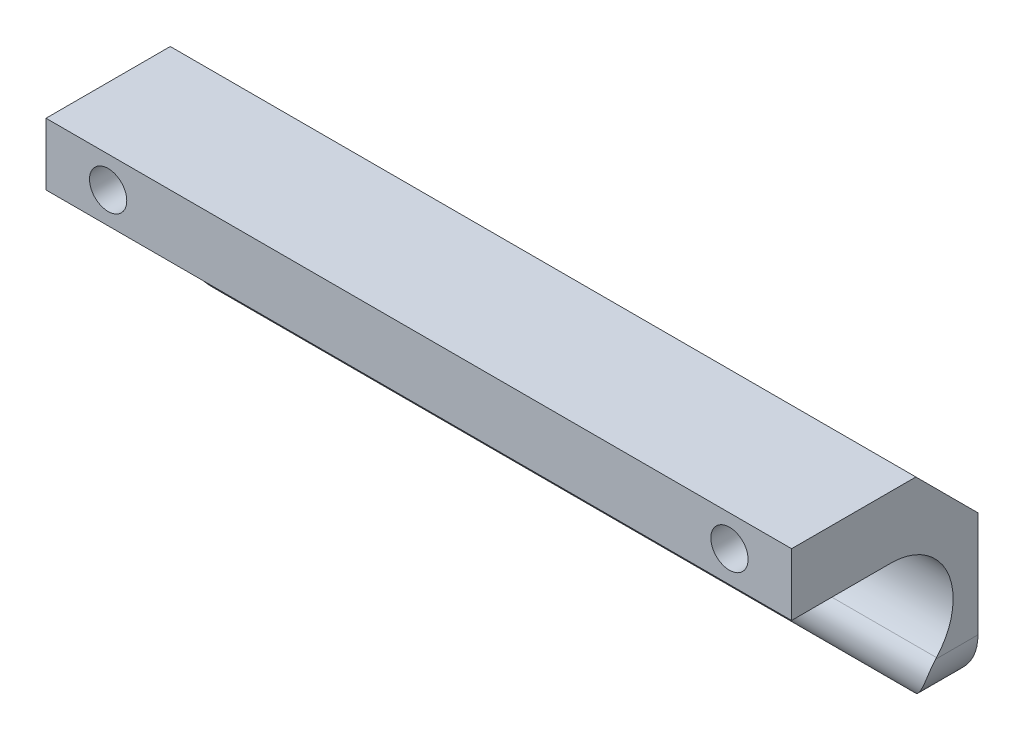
ISO-10303-21;
HEADER;
FILE_DESCRIPTION(('STEP AP214'),'2;1');
FILE_NAME('part.step','',(''),(''),'','','');
FILE_SCHEMA(('AUTOMOTIVE_DESIGN { 1 0 10303 214 1 1 1 1 }'));
ENDSEC;
DATA;
#1=APPLICATION_CONTEXT('core data for automotive mechanical design processes');
#2=APPLICATION_PROTOCOL_DEFINITION('international standard','automotive_design',2000,#1);
#3=PRODUCT_CONTEXT('',#1,'mechanical');
#4=PRODUCT('Part','Part','',(#3));
#5=PRODUCT_RELATED_PRODUCT_CATEGORY('part','',(#4));
#6=PRODUCT_DEFINITION_FORMATION('','',#4);
#7=PRODUCT_DEFINITION_CONTEXT('part definition',#1,'design');
#8=PRODUCT_DEFINITION('design','',#6,#7);
#9=PRODUCT_DEFINITION_SHAPE('','',#8);
#10=(LENGTH_UNIT() NAMED_UNIT(*) SI_UNIT(.MILLI.,.METRE.));
#11=(NAMED_UNIT(*) PLANE_ANGLE_UNIT() SI_UNIT($,.RADIAN.));
#12=(NAMED_UNIT(*) SI_UNIT($,.STERADIAN.) SOLID_ANGLE_UNIT());
#13=UNCERTAINTY_MEASURE_WITH_UNIT(LENGTH_MEASURE(1.E-05),#10,'distance_accuracy_value','');
#14=(GEOMETRIC_REPRESENTATION_CONTEXT(3) GLOBAL_UNCERTAINTY_ASSIGNED_CONTEXT((#13)) GLOBAL_UNIT_ASSIGNED_CONTEXT((#10,
#11,#12)) REPRESENTATION_CONTEXT('',''));
#15=CARTESIAN_POINT('',(0.,0.,0.));
#16=DIRECTION('',(0.,0.,1.));
#17=DIRECTION('',(1.,0.,0.));
#18=AXIS2_PLACEMENT_3D('',#15,#16,#17);
#19=CARTESIAN_POINT('',(-60.,17.5,-15.));
#20=DIRECTION('',(-1.,0.,0.));
#21=DIRECTION('',(0.,0.,1.));
#22=AXIS2_PLACEMENT_3D('',#19,#20,#21);
#23=PLANE('',#22);
#24=DIRECTION('',(0.,1.,0.));
#25=VECTOR('',#24,1.);
#26=CARTESIAN_POINT('',(-60.,-17.5,-15.));
#27=LINE('',#26,#25);
#28=CARTESIAN_POINT('',(-60.,-9.5,-15.));
#29=VERTEX_POINT('',#28);
#30=CARTESIAN_POINT('',(-60.,7.49999999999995,-15.));
#31=VERTEX_POINT('',#30);
#32=EDGE_CURVE('E203',#29,#31,#27,.T.);
#33=ORIENTED_EDGE('',*,*,#32,.F.);
#34=DIRECTION('',(0.,0.,-1.));
#35=VECTOR('',#34,1.);
#36=CARTESIAN_POINT('',(-60.,-9.5,15.));
#37=LINE('',#36,#35);
#38=CARTESIAN_POINT('',(-60.,-9.5,-8.15302564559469));
#39=VERTEX_POINT('',#38);
#40=EDGE_CURVE('E163',#39,#29,#37,.T.);
#41=ORIENTED_EDGE('',*,*,#40,.F.);
#42=CARTESIAN_POINT('',(-60.,-12.642135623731,-11.857864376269));
#43=DIRECTION('',(1.,0.,0.));
#44=DIRECTION('',(0.,0.,-1.));
#45=AXIS2_PLACEMENT_3D('',#42,#43,#44);
#46=CIRCLE('',#45,4.85786437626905);
#47=CARTESIAN_POINT('',(-60.,-9.32610593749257,-8.30782305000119));
#48=VERTEX_POINT('',#47);
#49=EDGE_CURVE('E176',#48,#39,#46,.T.);
#50=ORIENTED_EDGE('',*,*,#49,.F.);
#51=CARTESIAN_POINT('',(-60.,-2.5,-0.999999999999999));
#52=DIRECTION('',(1.,0.,0.));
#53=DIRECTION('',(0.,0.,-1.));
#54=AXIS2_PLACEMENT_3D('',#51,#52,#53);
#55=CIRCLE('',#54,10.);
#56=CARTESIAN_POINT('',(-60.,7.5,-1.));
#57=VERTEX_POINT('',#56);
#58=EDGE_CURVE('E180',#48,#57,#55,.T.);
#59=ORIENTED_EDGE('',*,*,#58,.T.);
#60=DIRECTION('',(0.,0.,1.));
#61=VECTOR('',#60,1.);
#62=CARTESIAN_POINT('',(-60.,7.5,-35.9970345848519));
#63=LINE('',#62,#61);
#64=CARTESIAN_POINT('',(-60.,7.5,15.));
#65=VERTEX_POINT('',#64);
#66=EDGE_CURVE('E185',#57,#65,#63,.T.);
#67=ORIENTED_EDGE('',*,*,#66,.T.);
#68=DIRECTION('',(0.,-1.,0.));
#69=VECTOR('',#68,1.);
#70=CARTESIAN_POINT('',(-60.,-17.5,15.));
#71=LINE('',#70,#69);
#72=CARTESIAN_POINT('',(-60.,17.5,15.));
#73=VERTEX_POINT('',#72);
#74=EDGE_CURVE('E212',#73,#65,#71,.T.);
#75=ORIENTED_EDGE('',*,*,#74,.F.);
#76=DIRECTION('',(0.,0.,1.));
#77=VECTOR('',#76,1.);
#78=CARTESIAN_POINT('',(-60.,17.5,15.));
#79=LINE('',#78,#77);
#80=CARTESIAN_POINT('',(-60.,17.5,-4.99999999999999));
#81=VERTEX_POINT('',#80);
#82=EDGE_CURVE('E222',#81,#73,#79,.T.);
#83=ORIENTED_EDGE('',*,*,#82,.F.);
#84=DIRECTION('',(0.,0.707106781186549,0.707106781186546));
#85=VECTOR('',#84,1.);
#86=CARTESIAN_POINT('',(-60.,12.5,-9.99999999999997));
#87=LINE('',#86,#85);
#88=EDGE_CURVE('E235',#81,#31,#87,.F.);
#89=ORIENTED_EDGE('',*,*,#88,.T.);
#90=EDGE_LOOP('',(#33,#41,#50,#59,#67,#75,#83,#89));
#91=FACE_BOUND('',#90,.T.);
#92=ADVANCED_FACE('F37',(#91),#23,.T.);
#93=CARTESIAN_POINT('',(60.,17.5,-15.));
#94=DIRECTION('',(-1.,0.,0.));
#95=DIRECTION('',(0.,0.,1.));
#96=AXIS2_PLACEMENT_3D('',#93,#94,#95);
#97=PLANE('',#96);
#98=DIRECTION('',(0.,0.,-1.));
#99=VECTOR('',#98,1.);
#100=CARTESIAN_POINT('',(60.,-9.5,15.));
#101=LINE('',#100,#99);
#102=CARTESIAN_POINT('',(60.,-9.5,-8.15302564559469));
#103=VERTEX_POINT('',#102);
#104=CARTESIAN_POINT('',(60.,-9.5,-15.));
#105=VERTEX_POINT('',#104);
#106=EDGE_CURVE('E169',#103,#105,#101,.T.);
#107=ORIENTED_EDGE('',*,*,#106,.T.);
#108=DIRECTION('',(0.,1.,0.));
#109=VECTOR('',#108,1.);
#110=CARTESIAN_POINT('',(60.,-17.5,-15.));
#111=LINE('',#110,#109);
#112=CARTESIAN_POINT('',(60.,7.49999999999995,-15.));
#113=VERTEX_POINT('',#112);
#114=EDGE_CURVE('E208',#105,#113,#111,.T.);
#115=ORIENTED_EDGE('',*,*,#114,.T.);
#116=DIRECTION('',(0.,-0.707106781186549,-0.707106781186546));
#117=VECTOR('',#116,1.);
#118=CARTESIAN_POINT('',(60.,17.5,-4.99999999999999));
#119=LINE('',#118,#117);
#120=CARTESIAN_POINT('',(60.,17.5,-4.99999999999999));
#121=VERTEX_POINT('',#120);
#122=EDGE_CURVE('E243',#113,#121,#119,.F.);
#123=ORIENTED_EDGE('',*,*,#122,.T.);
#124=DIRECTION('',(0.,0.,1.));
#125=VECTOR('',#124,1.);
#126=CARTESIAN_POINT('',(60.,17.5,15.));
#127=LINE('',#126,#125);
#128=CARTESIAN_POINT('',(60.,17.5,15.));
#129=VERTEX_POINT('',#128);
#130=EDGE_CURVE('E211',#121,#129,#127,.T.);
#131=ORIENTED_EDGE('',*,*,#130,.T.);
#132=DIRECTION('',(0.,-1.,0.));
#133=VECTOR('',#132,1.);
#134=CARTESIAN_POINT('',(60.,-17.5,15.));
#135=LINE('',#134,#133);
#136=CARTESIAN_POINT('',(60.,7.5,15.));
#137=VERTEX_POINT('',#136);
#138=EDGE_CURVE('E215',#129,#137,#135,.T.);
#139=ORIENTED_EDGE('',*,*,#138,.T.);
#140=DIRECTION('',(0.,0.,1.));
#141=VECTOR('',#140,1.);
#142=CARTESIAN_POINT('',(60.,7.5,-35.9970345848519));
#143=LINE('',#142,#141);
#144=CARTESIAN_POINT('',(60.,7.5,-1.));
#145=VERTEX_POINT('',#144);
#146=EDGE_CURVE('E181',#145,#137,#143,.T.);
#147=ORIENTED_EDGE('',*,*,#146,.F.);
#148=CARTESIAN_POINT('',(60.,-2.5,-0.999999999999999));
#149=DIRECTION('',(1.,0.,0.));
#150=DIRECTION('',(0.,0.,-1.));
#151=AXIS2_PLACEMENT_3D('',#148,#149,#150);
#152=CIRCLE('',#151,10.);
#153=CARTESIAN_POINT('',(60.,-9.32610593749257,-8.30782305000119));
#154=VERTEX_POINT('',#153);
#155=EDGE_CURVE('E193',#154,#145,#152,.T.);
#156=ORIENTED_EDGE('',*,*,#155,.F.);
#157=CARTESIAN_POINT('',(60.,-12.642135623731,-11.857864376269));
#158=DIRECTION('',(1.,0.,0.));
#159=DIRECTION('',(0.,0.,-1.));
#160=AXIS2_PLACEMENT_3D('',#157,#158,#159);
#161=CIRCLE('',#160,4.85786437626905);
#162=EDGE_CURVE('E175',#154,#103,#161,.T.);
#163=ORIENTED_EDGE('',*,*,#162,.T.);
#164=EDGE_LOOP('',(#107,#115,#123,#131,#139,#147,#156,#163));
#165=FACE_BOUND('',#164,.T.);
#166=ADVANCED_FACE('F267',(#165),#97,.F.);
#167=CARTESIAN_POINT('',(60.,-17.5,-15.));
#168=DIRECTION('',(0.,0.,1.));
#169=DIRECTION('',(1.,0.,0.));
#170=AXIS2_PLACEMENT_3D('',#167,#168,#169);
#171=PLANE('',#170);
#172=DIRECTION('',(1.,0.,0.));
#173=VECTOR('',#172,1.);
#174=CARTESIAN_POINT('',(-60.,-16.3469743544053,-15.));
#175=LINE('',#174,#173);
#176=CARTESIAN_POINT('',(-56.1375043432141,-16.3469743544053,-15.));
#177=VERTEX_POINT('',#176);
#178=CARTESIAN_POINT('',(56.1375043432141,-16.3469743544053,-15.));
#179=VERTEX_POINT('',#178);
#180=EDGE_CURVE('E172',#177,#179,#175,.T.);
#181=ORIENTED_EDGE('',*,*,#180,.F.);
#182=CARTESIAN_POINT('',(-52.,-9.5,-15.));
#183=DIRECTION('',(0.,0.,1.));
#184=DIRECTION('',(-1.,0.,0.));
#185=AXIS2_PLACEMENT_3D('',#182,#183,#184);
#186=CIRCLE('',#185,8.);
#187=EDGE_CURVE('E160',#29,#177,#186,.T.);
#188=ORIENTED_EDGE('',*,*,#187,.F.);
#189=ORIENTED_EDGE('',*,*,#32,.T.);
#190=DIRECTION('',(1.,0.,0.));
#191=VECTOR('',#190,1.);
#192=CARTESIAN_POINT('',(60.,7.49999999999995,-15.));
#193=LINE('',#192,#191);
#194=EDGE_CURVE('E239',#31,#113,#193,.T.);
#195=ORIENTED_EDGE('',*,*,#194,.T.);
#196=ORIENTED_EDGE('',*,*,#114,.F.);
#197=CARTESIAN_POINT('',(52.,-9.5,-15.));
#198=DIRECTION('',(0.,0.,1.));
#199=DIRECTION('',(-1.,0.,0.));
#200=AXIS2_PLACEMENT_3D('',#197,#198,#199);
#201=CIRCLE('',#200,8.);
#202=EDGE_CURVE('E166',#179,#105,#201,.T.);
#203=ORIENTED_EDGE('',*,*,#202,.F.);
#204=EDGE_LOOP('',(#181,#188,#189,#195,#196,#203));
#205=FACE_BOUND('',#204,.T.);
#206=ADVANCED_FACE('F314',(#205),#171,.F.);
#207=CARTESIAN_POINT('',(60.,17.5,15.));
#208=DIRECTION('',(0.,-1.,0.));
#209=DIRECTION('',(0.,0.,-1.));
#210=AXIS2_PLACEMENT_3D('',#207,#208,#209);
#211=PLANE('',#210);
#212=ORIENTED_EDGE('',*,*,#130,.F.);
#213=DIRECTION('',(-1.,0.,0.));
#214=VECTOR('',#213,1.);
#215=CARTESIAN_POINT('',(60.,17.5,-4.99999999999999));
#216=LINE('',#215,#214);
#217=EDGE_CURVE('E231',#121,#81,#216,.T.);
#218=ORIENTED_EDGE('',*,*,#217,.T.);
#219=ORIENTED_EDGE('',*,*,#82,.T.);
#220=DIRECTION('',(-1.,0.,0.));
#221=VECTOR('',#220,1.);
#222=CARTESIAN_POINT('',(60.,17.5,15.));
#223=LINE('',#222,#221);
#224=EDGE_CURVE('E219',#129,#73,#223,.T.);
#225=ORIENTED_EDGE('',*,*,#224,.F.);
#226=EDGE_LOOP('',(#212,#218,#219,#225));
#227=FACE_BOUND('',#226,.T.);
#228=ADVANCED_FACE('F321',(#227),#211,.F.);
#229=CARTESIAN_POINT('',(60.,-17.5,15.));
#230=DIRECTION('',(0.,0.,-1.));
#231=DIRECTION('',(-1.,0.,0.));
#232=AXIS2_PLACEMENT_3D('',#229,#230,#231);
#233=PLANE('',#232);
#234=CARTESIAN_POINT('',(50.,12.5,15.));
#235=DIRECTION('',(0.,0.,1.));
#236=DIRECTION('',(1.,0.,0.));
#237=AXIS2_PLACEMENT_3D('',#234,#235,#236);
#238=CIRCLE('',#237,3.);
#239=CARTESIAN_POINT('',(53.,12.5,15.));
#240=VERTEX_POINT('',#239);
#241=EDGE_CURVE('E353',#240,#240,#238,.T.);
#242=ORIENTED_EDGE('',*,*,#241,.F.);
#243=EDGE_LOOP('',(#242));
#244=FACE_BOUND('',#243,.T.);
#245=CARTESIAN_POINT('',(-50.,12.5,15.));
#246=DIRECTION('',(0.,0.,1.));
#247=DIRECTION('',(1.,0.,0.));
#248=AXIS2_PLACEMENT_3D('',#245,#246,#247);
#249=CIRCLE('',#248,3.);
#250=CARTESIAN_POINT('',(-47.,12.5,15.));
#251=VERTEX_POINT('',#250);
#252=EDGE_CURVE('E134',#251,#251,#249,.T.);
#253=ORIENTED_EDGE('',*,*,#252,.F.);
#254=EDGE_LOOP('',(#253));
#255=FACE_BOUND('',#254,.T.);
#256=ORIENTED_EDGE('',*,*,#74,.T.);
#257=DIRECTION('',(1.,0.,0.));
#258=VECTOR('',#257,1.);
#259=CARTESIAN_POINT('',(-60.,7.5,15.));
#260=LINE('',#259,#258);
#261=EDGE_CURVE('E199',#65,#137,#260,.T.);
#262=ORIENTED_EDGE('',*,*,#261,.T.);
#263=ORIENTED_EDGE('',*,*,#138,.F.);
#264=ORIENTED_EDGE('',*,*,#224,.T.);
#265=EDGE_LOOP('',(#256,#262,#263,#264));
#266=FACE_BOUND('',#265,.T.);
#267=ADVANCED_FACE('F318',(#244,#255,#266),#233,.F.);
#268=CARTESIAN_POINT('',(60.,17.5,-4.99999999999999));
#269=DIRECTION('',(0.,-0.707106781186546,0.707106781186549));
#270=DIRECTION('',(0.,-0.707106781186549,-0.707106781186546));
#271=AXIS2_PLACEMENT_3D('',#268,#269,#270);
#272=PLANE('',#271);
#273=ORIENTED_EDGE('',*,*,#122,.F.);
#274=ORIENTED_EDGE('',*,*,#194,.F.);
#275=ORIENTED_EDGE('',*,*,#88,.F.);
#276=ORIENTED_EDGE('',*,*,#217,.F.);
#277=EDGE_LOOP('',(#273,#274,#275,#276));
#278=FACE_BOUND('',#277,.T.);
#279=ADVANCED_FACE('F39',(#278),#272,.F.);
#280=CARTESIAN_POINT('',(-60.,-12.642135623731,-11.857864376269));
#281=DIRECTION('',(1.,0.,0.));
#282=DIRECTION('',(0.,0.,-1.));
#283=AXIS2_PLACEMENT_3D('',#280,#281,#282);
#284=CYLINDRICAL_SURFACE('',#283,4.85786437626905);
#285=CARTESIAN_POINT('',(-56.1375043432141,-16.3469743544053,-15.));
#286=CARTESIAN_POINT('',(-56.0261493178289,-16.4142592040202,-14.9206561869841));
#287=CARTESIAN_POINT('',(-55.9139235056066,-16.4783721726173,-14.8399052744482));
#288=CARTESIAN_POINT('',(-55.6879480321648,-16.6003901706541,-14.6759350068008));
#289=CARTESIAN_POINT('',(-55.5741986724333,-16.6582964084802,-14.5927161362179));
#290=CARTESIAN_POINT('',(-55.2311071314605,-16.8228592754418,-14.3399621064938));
#291=CARTESIAN_POINT('',(-54.9997446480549,-16.9204660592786,-14.167202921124));
#292=CARTESIAN_POINT('',(-54.5341663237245,-17.0920563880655,-13.8161969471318));
#293=CARTESIAN_POINT('',(-54.2999657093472,-17.1661334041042,-13.6379750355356));
#294=CARTESIAN_POINT('',(-53.8289391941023,-17.2919435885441,-13.2772338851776));
#295=CARTESIAN_POINT('',(-53.5921135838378,-17.3436792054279,-13.0947151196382));
#296=CARTESIAN_POINT('',(-53.1319730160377,-17.422727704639,-12.738708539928));
#297=CARTESIAN_POINT('',(-52.9087578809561,-17.4513858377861,-12.5653856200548));
#298=CARTESIAN_POINT('',(-52.4617109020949,-17.4898128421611,-12.2176471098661));
#299=CARTESIAN_POINT('',(-52.2378795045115,-17.4995929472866,-12.04323223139));
#300=CARTESIAN_POINT('',(-52.0094068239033,-17.4999958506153,-11.8651946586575));
#301=CARTESIAN_POINT('',(-52.0047033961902,-17.4999999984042,-11.8615295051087));
#302=CARTESIAN_POINT('',(-52.,-17.5,-11.857864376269));
#303=B_SPLINE_CURVE_WITH_KNOTS('',3,(#285,#286,#287,#288,#289,#290,#291,#292,#293,#294,#295,
#296,#297,#298,#299,#300,#301,#302),.UNSPECIFIED.,.F.,.F.,(4,2,2,2,2,2,2,2,4),(0.,
0.457072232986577,0.914055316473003,1.82729816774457,2.73686646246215,3.64633504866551,
4.49789854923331,5.348955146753,5.36684369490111),.UNSPECIFIED.);
#304=CARTESIAN_POINT('',(-52.,-17.5,-11.857864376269));
#305=VERTEX_POINT('',#304);
#306=EDGE_CURVE('E11',#177,#305,#303,.T.);
#307=ORIENTED_EDGE('',*,*,#306,.F.);
#308=ORIENTED_EDGE('',*,*,#180,.T.);
#309=CARTESIAN_POINT('',(56.1375043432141,-16.3469743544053,-15.));
#310=CARTESIAN_POINT('',(56.0261493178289,-16.4142592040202,-14.9206561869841));
#311=CARTESIAN_POINT('',(55.9139235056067,-16.4783721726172,-14.8399052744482));
#312=CARTESIAN_POINT('',(55.687948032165,-16.600390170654,-14.6759350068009));
#313=CARTESIAN_POINT('',(55.5741986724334,-16.6582964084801,-14.592716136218));
#314=CARTESIAN_POINT('',(55.2311071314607,-16.8228592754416,-14.339962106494));
#315=CARTESIAN_POINT('',(54.9997446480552,-16.9204660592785,-14.1672029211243));
#316=CARTESIAN_POINT('',(54.5341663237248,-17.0920563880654,-13.816196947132));
#317=CARTESIAN_POINT('',(54.2999657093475,-17.1661334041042,-13.6379750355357));
#318=CARTESIAN_POINT('',(53.8289391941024,-17.2919435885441,-13.2772338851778));
#319=CARTESIAN_POINT('',(53.5921135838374,-17.3436792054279,-13.0947151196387));
#320=CARTESIAN_POINT('',(53.1319730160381,-17.4227277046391,-12.7387085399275));
#321=CARTESIAN_POINT('',(52.9087578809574,-17.4513858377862,-12.5653856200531));
#322=CARTESIAN_POINT('',(52.4617109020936,-17.4898128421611,-12.2176471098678));
#323=CARTESIAN_POINT('',(52.2378795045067,-17.4995929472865,-12.0432322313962));
#324=CARTESIAN_POINT('',(52.0094068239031,-17.4999958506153,-11.8651946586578));
#325=CARTESIAN_POINT('',(52.0047033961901,-17.4999999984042,-11.8615295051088));
#326=CARTESIAN_POINT('',(52.,-17.5,-11.857864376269));
#327=B_SPLINE_CURVE_WITH_KNOTS('',3,(#309,#310,#311,#312,#313,#314,#315,#316,#317,#318,#319,
#320,#321,#322,#323,#324,#325,#326),.UNSPECIFIED.,.F.,.F.,(4,2,2,2,2,2,2,2,4),(0.,
0.457072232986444,0.91405531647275,1.82729816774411,2.73686646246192,3.6463350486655,
4.49789854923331,5.348955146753,5.3668436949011),.UNSPECIFIED.);
#328=CARTESIAN_POINT('',(52.,-17.5,-11.857864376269));
#329=VERTEX_POINT('',#328);
#330=EDGE_CURVE('E246',#329,#179,#327,.F.);
#331=ORIENTED_EDGE('',*,*,#330,.F.);
#332=CARTESIAN_POINT('',(60.,-9.5,-8.15302564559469));
#333=CARTESIAN_POINT('',(60.0000097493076,-9.59352523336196,-8.07368202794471));
#334=CARTESIAN_POINT('',(59.9983604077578,-9.69008993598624,-7.99789663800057));
#335=CARTESIAN_POINT('',(59.9911711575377,-9.88859852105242,-7.85388207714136));
#336=CARTESIAN_POINT('',(59.9856301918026,-9.99054385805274,-7.78565496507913));
#337=CARTESIAN_POINT('',(59.9700913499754,-10.198972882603,-7.65729543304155));
#338=CARTESIAN_POINT('',(59.9600973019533,-10.3054526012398,-7.59715611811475));
#339=CARTESIAN_POINT('',(59.9351784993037,-10.52217077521,-7.48528386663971));
#340=CARTESIAN_POINT('',(59.9202543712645,-10.6324087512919,-7.43354986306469));
#341=CARTESIAN_POINT('',(59.8850588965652,-10.8559787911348,-7.33865317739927));
#342=CARTESIAN_POINT('',(59.8647759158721,-10.9693170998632,-7.29550950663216));
#343=CARTESIAN_POINT('',(59.8186122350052,-11.1979113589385,-7.21807659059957));
#344=CARTESIAN_POINT('',(59.7927294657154,-11.3131680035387,-7.1837906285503));
#345=CARTESIAN_POINT('',(59.735281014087,-11.5444077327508,-7.12414698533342));
#346=CARTESIAN_POINT('',(59.703722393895,-11.6603897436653,-7.09877832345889));
#347=CARTESIAN_POINT('',(59.6348944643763,-11.8922834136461,-7.05677505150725));
#348=CARTESIAN_POINT('',(59.5976230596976,-12.0081950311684,-7.04014365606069));
#349=CARTESIAN_POINT('',(59.51821752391,-12.2369330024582,-7.01558661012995));
#350=CARTESIAN_POINT('',(59.4761815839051,-12.34977757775,-7.00751149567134));
#351=CARTESIAN_POINT('',(59.386927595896,-12.5737336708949,-6.99918860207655));
#352=CARTESIAN_POINT('',(59.3397075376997,-12.6848444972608,-6.99894387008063));
#353=CARTESIAN_POINT('',(59.2403552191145,-12.9046752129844,-7.00585245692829));
#354=CARTESIAN_POINT('',(59.188220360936,-13.0133938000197,-7.01300970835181));
#355=CARTESIAN_POINT('',(59.0793844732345,-13.2278389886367,-7.03423365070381));
#356=CARTESIAN_POINT('',(59.0226824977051,-13.3335649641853,-7.04830177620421));
#357=CARTESIAN_POINT('',(58.8837240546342,-13.5793186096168,-7.08909377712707));
#358=CARTESIAN_POINT('',(58.7996590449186,-13.7178767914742,-7.11855734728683));
#359=CARTESIAN_POINT('',(58.6246176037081,-13.9877993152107,-7.18801715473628));
#360=CARTESIAN_POINT('',(58.5336391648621,-14.1191615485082,-7.22801645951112));
#361=CARTESIAN_POINT('',(58.34555598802,-14.3743273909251,-7.3173084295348));
#362=CARTESIAN_POINT('',(58.2484445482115,-14.4981224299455,-7.36661138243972));
#363=CARTESIAN_POINT('',(58.0489770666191,-14.7377664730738,-7.47330173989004));
#364=CARTESIAN_POINT('',(57.9466195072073,-14.8536131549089,-7.53069149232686));
#365=CARTESIAN_POINT('',(57.6981722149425,-15.11917656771,-7.67530997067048));
#366=CARTESIAN_POINT('',(57.5500680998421,-15.2653178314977,-7.76566141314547));
#367=CARTESIAN_POINT('',(57.24698708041,-15.5424592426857,-7.95717871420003));
#368=CARTESIAN_POINT('',(57.0920104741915,-15.6734600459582,-8.05834410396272));
#369=CARTESIAN_POINT('',(56.7761676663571,-15.9209458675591,-8.26972021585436));
#370=CARTESIAN_POINT('',(56.615290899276,-16.0374030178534,-8.37994765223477));
#371=CARTESIAN_POINT('',(56.2890167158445,-16.2559526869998,-8.60762234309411));
#372=CARTESIAN_POINT('',(56.1236192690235,-16.3580451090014,-8.72506964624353));
#373=CARTESIAN_POINT('',(55.7251962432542,-16.5847491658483,-9.0118749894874));
#374=CARTESIAN_POINT('',(55.4904917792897,-16.7030468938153,-9.18391192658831));
#375=CARTESIAN_POINT('',(55.0159252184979,-16.9142900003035,-9.53627860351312));
#376=CARTESIAN_POINT('',(54.7760611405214,-17.0072254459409,-9.71661156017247));
#377=CARTESIAN_POINT('',(54.2929259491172,-17.1685898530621,-10.0830184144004));
#378=CARTESIAN_POINT('',(54.0496584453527,-17.2370429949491,-10.2690864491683));
#379=CARTESIAN_POINT('',(53.5608069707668,-17.3502768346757,-10.6450941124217));
#380=CARTESIAN_POINT('',(53.3152234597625,-17.395062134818,-10.8350329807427));
#381=CARTESIAN_POINT('',(52.7182200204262,-17.4755446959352,-11.2982018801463));
#382=CARTESIAN_POINT('',(52.366010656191,-17.4993671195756,-11.5726501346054));
#383=CARTESIAN_POINT('',(52.0094067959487,-17.4999958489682,-11.8505341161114));
#384=CARTESIAN_POINT('',(52.0047033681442,-17.4999999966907,-11.8541992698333));
#385=CARTESIAN_POINT('',(52.,-17.5,-11.857864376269));
#386=B_SPLINE_CURVE_WITH_KNOTS('',3,(#332,#333,#334,#335,#336,#337,#338,#339,#340,#341,#342,
#343,#344,#345,#346,#347,#348,#349,#350,#351,#352,#353,#354,#355,#356,#357,#358,#359,#360,#361,
#362,#363,#364,#365,#366,#367,#368,#369,#370,#371,#372,#373,#374,#375,#376,#377,#378,#379,#380,
#381,#382,#383,#384,#385),.UNSPECIFIED.,.F.,.F.,(4,2,2,2,2,2,2,2,2,2,2,2,2,2,2,2,2,2,2,2,2,2,2,
2,2,2,4),(0.,0.367866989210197,0.735833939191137,1.10348517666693,1.47108970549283,
1.83949895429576,2.2080445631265,2.57613474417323,2.94436025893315,3.30604174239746,
3.66786397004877,4.02987852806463,4.391968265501,4.8854077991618,5.3789911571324,
5.87312353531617,6.36739967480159,7.04689686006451,7.72636459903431,8.40711495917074,
9.08786990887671,10.0289002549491,10.9702986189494,11.910764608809,12.8510476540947,
14.189414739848,14.2073032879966),.UNSPECIFIED.);
#387=EDGE_CURVE('E64',#103,#329,#386,.T.);
#388=ORIENTED_EDGE('',*,*,#387,.F.);
#389=ORIENTED_EDGE('',*,*,#162,.F.);
#390=DIRECTION('',(1.,0.,0.));
#391=VECTOR('',#390,1.);
#392=CARTESIAN_POINT('',(-60.,-9.32610593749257,-8.30782305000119));
#393=LINE('',#392,#391);
#394=EDGE_CURVE('E189',#48,#154,#393,.T.);
#395=ORIENTED_EDGE('',*,*,#394,.F.);
#396=ORIENTED_EDGE('',*,*,#49,.T.);
#397=CARTESIAN_POINT('',(-60.,-9.5,-8.15302564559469));
#398=CARTESIAN_POINT('',(-60.0000097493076,-9.59352523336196,-8.07368202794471));
#399=CARTESIAN_POINT('',(-59.9983604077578,-9.69008993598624,-7.99789663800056));
#400=CARTESIAN_POINT('',(-59.9911711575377,-9.88859852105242,-7.85388207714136));
#401=CARTESIAN_POINT('',(-59.9856301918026,-9.99054385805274,-7.78565496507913));
#402=CARTESIAN_POINT('',(-59.9700913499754,-10.198972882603,-7.65729543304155));
#403=CARTESIAN_POINT('',(-59.9600973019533,-10.3054526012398,-7.59715611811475));
#404=CARTESIAN_POINT('',(-59.9351784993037,-10.52217077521,-7.48528386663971));
#405=CARTESIAN_POINT('',(-59.9202543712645,-10.6324087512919,-7.43354986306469));
#406=CARTESIAN_POINT('',(-59.8850588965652,-10.8559787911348,-7.33865317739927));
#407=CARTESIAN_POINT('',(-59.8647759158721,-10.9693170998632,-7.29550950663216));
#408=CARTESIAN_POINT('',(-59.8186122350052,-11.1979113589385,-7.21807659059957));
#409=CARTESIAN_POINT('',(-59.7927294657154,-11.3131680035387,-7.1837906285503));
#410=CARTESIAN_POINT('',(-59.735281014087,-11.5444077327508,-7.12414698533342));
#411=CARTESIAN_POINT('',(-59.703722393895,-11.6603897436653,-7.09877832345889));
#412=CARTESIAN_POINT('',(-59.6348944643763,-11.8922834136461,-7.05677505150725));
#413=CARTESIAN_POINT('',(-59.5976230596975,-12.0081950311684,-7.04014365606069));
#414=CARTESIAN_POINT('',(-59.51821752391,-12.2369330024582,-7.01558661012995));
#415=CARTESIAN_POINT('',(-59.4761815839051,-12.34977757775,-7.00751149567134));
#416=CARTESIAN_POINT('',(-59.386927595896,-12.5737336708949,-6.99918860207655));
#417=CARTESIAN_POINT('',(-59.3397075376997,-12.6848444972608,-6.99894387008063));
#418=CARTESIAN_POINT('',(-59.2403552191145,-12.9046752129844,-7.00585245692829));
#419=CARTESIAN_POINT('',(-59.1882203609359,-13.0133938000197,-7.01300970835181));
#420=CARTESIAN_POINT('',(-59.0793844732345,-13.2278389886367,-7.03423365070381));
#421=CARTESIAN_POINT('',(-59.0226824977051,-13.3335649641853,-7.04830177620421));
#422=CARTESIAN_POINT('',(-58.8837240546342,-13.5793186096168,-7.08909377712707));
#423=CARTESIAN_POINT('',(-58.7996590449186,-13.7178767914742,-7.11855734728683));
#424=CARTESIAN_POINT('',(-58.6246176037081,-13.9877993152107,-7.18801715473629));
#425=CARTESIAN_POINT('',(-58.5336391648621,-14.1191615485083,-7.22801645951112));
#426=CARTESIAN_POINT('',(-58.34555598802,-14.3743273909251,-7.3173084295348));
#427=CARTESIAN_POINT('',(-58.2484445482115,-14.4981224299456,-7.36661138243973));
#428=CARTESIAN_POINT('',(-58.0489770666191,-14.7377664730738,-7.47330173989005));
#429=CARTESIAN_POINT('',(-57.9466195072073,-14.8536131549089,-7.53069149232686));
#430=CARTESIAN_POINT('',(-57.6981722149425,-15.11917656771,-7.67530997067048));
#431=CARTESIAN_POINT('',(-57.5500680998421,-15.2653178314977,-7.76566141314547));
#432=CARTESIAN_POINT('',(-57.24698708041,-15.5424592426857,-7.95717871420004));
#433=CARTESIAN_POINT('',(-57.0920104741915,-15.6734600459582,-8.05834410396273));
#434=CARTESIAN_POINT('',(-56.776167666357,-15.9209458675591,-8.26972021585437));
#435=CARTESIAN_POINT('',(-56.615290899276,-16.0374030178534,-8.37994765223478));
#436=CARTESIAN_POINT('',(-56.2890167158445,-16.2559526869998,-8.60762234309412));
#437=CARTESIAN_POINT('',(-56.1236192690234,-16.3580451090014,-8.72506964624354));
#438=CARTESIAN_POINT('',(-55.7251962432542,-16.5847491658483,-9.01187498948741));
#439=CARTESIAN_POINT('',(-55.4904917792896,-16.7030468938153,-9.18391192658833));
#440=CARTESIAN_POINT('',(-55.0159252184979,-16.9142900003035,-9.53627860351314));
#441=CARTESIAN_POINT('',(-54.7760611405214,-17.0072254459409,-9.71661156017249));
#442=CARTESIAN_POINT('',(-54.2929259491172,-17.1685898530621,-10.0830184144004));
#443=CARTESIAN_POINT('',(-54.0496584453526,-17.2370429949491,-10.2690864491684));
#444=CARTESIAN_POINT('',(-53.5608069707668,-17.3502768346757,-10.6450941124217));
#445=CARTESIAN_POINT('',(-53.3152234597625,-17.395062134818,-10.8350329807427));
#446=CARTESIAN_POINT('',(-52.7182200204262,-17.4755446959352,-11.2982018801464));
#447=CARTESIAN_POINT('',(-52.3660106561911,-17.4993671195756,-11.5726501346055));
#448=CARTESIAN_POINT('',(-52.0094067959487,-17.4999958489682,-11.8505341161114));
#449=CARTESIAN_POINT('',(-52.0047033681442,-17.4999999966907,-11.8541992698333));
#450=CARTESIAN_POINT('',(-52.,-17.5,-11.857864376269));
#451=B_SPLINE_CURVE_WITH_KNOTS('',3,(#397,#398,#399,#400,#401,#402,#403,#404,#405,#406,#407,
#408,#409,#410,#411,#412,#413,#414,#415,#416,#417,#418,#419,#420,#421,#422,#423,#424,#425,#426,
#427,#428,#429,#430,#431,#432,#433,#434,#435,#436,#437,#438,#439,#440,#441,#442,#443,#444,#445,
#446,#447,#448,#449,#450),.UNSPECIFIED.,.F.,.F.,(4,2,2,2,2,2,2,2,2,2,2,2,2,2,2,2,2,2,2,2,2,2,2,
2,2,2,4),(0.,0.367866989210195,0.735833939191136,1.10348517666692,1.47108970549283,
1.83949895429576,2.2080445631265,2.57613474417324,2.94436025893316,3.30604174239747,
3.66786397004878,4.02987852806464,4.391968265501,4.8854077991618,5.37899115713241,
5.87312353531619,6.3673996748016,7.04689686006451,7.72636459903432,8.40711495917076,
9.08786990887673,10.0289002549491,10.9702986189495,11.9107646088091,12.8510476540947,
14.189414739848,14.2073032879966),.UNSPECIFIED.);
#452=EDGE_CURVE('E51',#305,#39,#451,.F.);
#453=ORIENTED_EDGE('',*,*,#452,.F.);
#454=EDGE_LOOP('',(#307,#308,#331,#388,#389,#395,#396,#453));
#455=FACE_BOUND('',#454,.T.);
#456=ADVANCED_FACE('F259',(#455),#284,.T.);
#457=CARTESIAN_POINT('',(-60.,7.5,-35.9970345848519));
#458=DIRECTION('',(0.,1.,0.));
#459=DIRECTION('',(0.,0.,1.));
#460=AXIS2_PLACEMENT_3D('',#457,#458,#459);
#461=PLANE('',#460);
#462=ORIENTED_EDGE('',*,*,#146,.T.);
#463=ORIENTED_EDGE('',*,*,#261,.F.);
#464=ORIENTED_EDGE('',*,*,#66,.F.);
#465=DIRECTION('',(1.,0.,0.));
#466=VECTOR('',#465,1.);
#467=CARTESIAN_POINT('',(-60.,7.5,-1.));
#468=LINE('',#467,#466);
#469=EDGE_CURVE('E204',#57,#145,#468,.T.);
#470=ORIENTED_EDGE('',*,*,#469,.T.);
#471=EDGE_LOOP('',(#462,#463,#464,#470));
#472=FACE_BOUND('',#471,.T.);
#473=ADVANCED_FACE('F264',(#472),#461,.F.);
#474=CARTESIAN_POINT('',(-60.,-2.5,-0.999999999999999));
#475=DIRECTION('',(1.,0.,0.));
#476=DIRECTION('',(0.,0.,-1.));
#477=AXIS2_PLACEMENT_3D('',#474,#475,#476);
#478=CYLINDRICAL_SURFACE('',#477,10.);
#479=ORIENTED_EDGE('',*,*,#155,.T.);
#480=ORIENTED_EDGE('',*,*,#469,.F.);
#481=ORIENTED_EDGE('',*,*,#58,.F.);
#482=ORIENTED_EDGE('',*,*,#394,.T.);
#483=EDGE_LOOP('',(#479,#480,#481,#482));
#484=FACE_BOUND('',#483,.T.);
#485=ADVANCED_FACE('F266',(#484),#478,.F.);
#486=CARTESIAN_POINT('',(52.,-9.5,15.));
#487=DIRECTION('',(0.,0.,-1.));
#488=DIRECTION('',(-1.,0.,0.));
#489=AXIS2_PLACEMENT_3D('',#486,#487,#488);
#490=CYLINDRICAL_SURFACE('',#489,8.);
#491=ORIENTED_EDGE('',*,*,#387,.T.);
#492=ORIENTED_EDGE('',*,*,#330,.T.);
#493=ORIENTED_EDGE('',*,*,#202,.T.);
#494=ORIENTED_EDGE('',*,*,#106,.F.);
#495=EDGE_LOOP('',(#491,#492,#493,#494));
#496=FACE_BOUND('',#495,.T.);
#497=ADVANCED_FACE('F256',(#496),#490,.T.);
#498=CARTESIAN_POINT('',(-52.,-9.5,15.));
#499=DIRECTION('',(0.,0.,-1.));
#500=DIRECTION('',(-1.,0.,0.));
#501=AXIS2_PLACEMENT_3D('',#498,#499,#500);
#502=CYLINDRICAL_SURFACE('',#501,8.);
#503=ORIENTED_EDGE('',*,*,#306,.T.);
#504=ORIENTED_EDGE('',*,*,#452,.T.);
#505=ORIENTED_EDGE('',*,*,#40,.T.);
#506=ORIENTED_EDGE('',*,*,#187,.T.);
#507=EDGE_LOOP('',(#503,#504,#505,#506));
#508=FACE_BOUND('',#507,.T.);
#509=ADVANCED_FACE('F276',(#508),#502,.T.);
#510=CARTESIAN_POINT('',(-50.,12.5,-2.));
#511=DIRECTION('',(0.,0.,1.));
#512=DIRECTION('',(1.,0.,0.));
#513=AXIS2_PLACEMENT_3D('',#510,#511,#512);
#514=CONICAL_SURFACE('',#513,2.5,1.02974425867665);
#515=CARTESIAN_POINT('',(-50.,12.5,-3.5021515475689));
#516=VERTEX_POINT('',#515);
#517=VERTEX_LOOP('',#516);
#518=FACE_BOUND('',#517,.T.);
#519=CARTESIAN_POINT('',(-50.,12.5,-2.));
#520=DIRECTION('',(0.,0.,1.));
#521=DIRECTION('',(1.,0.,0.));
#522=AXIS2_PLACEMENT_3D('',#519,#520,#521);
#523=CIRCLE('',#522,2.5);
#524=CARTESIAN_POINT('',(-47.5,12.5,-2.));
#525=VERTEX_POINT('',#524);
#526=EDGE_CURVE('E156',#525,#525,#523,.T.);
#527=ORIENTED_EDGE('',*,*,#526,.T.);
#528=EDGE_LOOP('',(#527));
#529=FACE_BOUND('',#528,.T.);
#530=ADVANCED_FACE('F280',(#518,#529),#514,.F.);
#531=CARTESIAN_POINT('',(-50.,12.5,15.));
#532=DIRECTION('',(0.,0.,1.));
#533=DIRECTION('',(1.,0.,0.));
#534=AXIS2_PLACEMENT_3D('',#531,#532,#533);
#535=CYLINDRICAL_SURFACE('',#534,2.5);
#536=ORIENTED_EDGE('',*,*,#526,.F.);
#537=EDGE_LOOP('',(#536));
#538=FACE_BOUND('',#537,.T.);
#539=CARTESIAN_POINT('',(-50.,12.5,3.));
#540=DIRECTION('',(0.,0.,1.));
#541=DIRECTION('',(1.,0.,0.));
#542=AXIS2_PLACEMENT_3D('',#539,#540,#541);
#543=CIRCLE('',#542,2.5);
#544=CARTESIAN_POINT('',(-47.5,12.5,3.));
#545=VERTEX_POINT('',#544);
#546=EDGE_CURVE('E152',#545,#545,#543,.T.);
#547=ORIENTED_EDGE('',*,*,#546,.T.);
#548=EDGE_LOOP('',(#547));
#549=FACE_BOUND('',#548,.T.);
#550=ADVANCED_FACE('F284',(#538,#549),#535,.F.);
#551=CARTESIAN_POINT('',(-47.5,12.5,3.));
#552=DIRECTION('',(0.,0.,-1.));
#553=DIRECTION('',(-1.,0.,0.));
#554=AXIS2_PLACEMENT_3D('',#551,#552,#553);
#555=PLANE('',#554);
#556=ORIENTED_EDGE('',*,*,#546,.F.);
#557=EDGE_LOOP('',(#556));
#558=FACE_BOUND('',#557,.T.);
#559=CARTESIAN_POINT('',(-50.,12.5,3.));
#560=DIRECTION('',(0.,0.,1.));
#561=DIRECTION('',(1.,0.,0.));
#562=AXIS2_PLACEMENT_3D('',#559,#560,#561);
#563=CIRCLE('',#562,3.);
#564=CARTESIAN_POINT('',(-47.,12.5,3.));
#565=VERTEX_POINT('',#564);
#566=EDGE_CURVE('E141',#565,#565,#563,.T.);
#567=ORIENTED_EDGE('',*,*,#566,.T.);
#568=EDGE_LOOP('',(#567));
#569=FACE_BOUND('',#568,.T.);
#570=ADVANCED_FACE('F288',(#558,#569),#555,.F.);
#571=CARTESIAN_POINT('',(-50.,12.5,15.));
#572=DIRECTION('',(0.,0.,1.));
#573=DIRECTION('',(1.,0.,0.));
#574=AXIS2_PLACEMENT_3D('',#571,#572,#573);
#575=CYLINDRICAL_SURFACE('',#574,3.);
#576=ORIENTED_EDGE('',*,*,#566,.F.);
#577=EDGE_LOOP('',(#576));
#578=FACE_BOUND('',#577,.T.);
#579=ORIENTED_EDGE('',*,*,#252,.T.);
#580=EDGE_LOOP('',(#579));
#581=FACE_BOUND('',#580,.T.);
#582=ADVANCED_FACE('F127',(#578,#581),#575,.F.);
#583=CARTESIAN_POINT('',(50.,12.5,-2.));
#584=DIRECTION('',(0.,0.,1.));
#585=DIRECTION('',(1.,0.,0.));
#586=AXIS2_PLACEMENT_3D('',#583,#584,#585);
#587=CONICAL_SURFACE('',#586,2.5,1.02974425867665);
#588=CARTESIAN_POINT('',(50.,12.5,-3.5021515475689));
#589=VERTEX_POINT('',#588);
#590=VERTEX_LOOP('',#589);
#591=FACE_BOUND('',#590,.T.);
#592=CARTESIAN_POINT('',(50.,12.5,-2.));
#593=DIRECTION('',(0.,0.,1.));
#594=DIRECTION('',(1.,0.,0.));
#595=AXIS2_PLACEMENT_3D('',#592,#593,#594);
#596=CIRCLE('',#595,2.5);
#597=CARTESIAN_POINT('',(52.5,12.5,-2.));
#598=VERTEX_POINT('',#597);
#599=EDGE_CURVE('E131',#598,#598,#596,.T.);
#600=ORIENTED_EDGE('',*,*,#599,.T.);
#601=EDGE_LOOP('',(#600));
#602=FACE_BOUND('',#601,.T.);
#603=ADVANCED_FACE('F123',(#591,#602),#587,.F.);
#604=CARTESIAN_POINT('',(50.,12.5,15.));
#605=DIRECTION('',(0.,0.,1.));
#606=DIRECTION('',(1.,0.,0.));
#607=AXIS2_PLACEMENT_3D('',#604,#605,#606);
#608=CYLINDRICAL_SURFACE('',#607,2.5);
#609=ORIENTED_EDGE('',*,*,#599,.F.);
#610=EDGE_LOOP('',(#609));
#611=FACE_BOUND('',#610,.T.);
#612=CARTESIAN_POINT('',(50.,12.5,3.));
#613=DIRECTION('',(0.,0.,1.));
#614=DIRECTION('',(1.,0.,0.));
#615=AXIS2_PLACEMENT_3D('',#612,#613,#614);
#616=CIRCLE('',#615,2.5);
#617=CARTESIAN_POINT('',(52.5,12.5,3.));
#618=VERTEX_POINT('',#617);
#619=EDGE_CURVE('E135',#618,#618,#616,.T.);
#620=ORIENTED_EDGE('',*,*,#619,.T.);
#621=EDGE_LOOP('',(#620));
#622=FACE_BOUND('',#621,.T.);
#623=ADVANCED_FACE('F126',(#611,#622),#608,.F.);
#624=CARTESIAN_POINT('',(52.5,12.5,3.));
#625=DIRECTION('',(0.,0.,-1.));
#626=DIRECTION('',(-1.,0.,0.));
#627=AXIS2_PLACEMENT_3D('',#624,#625,#626);
#628=PLANE('',#627);
#629=ORIENTED_EDGE('',*,*,#619,.F.);
#630=EDGE_LOOP('',(#629));
#631=FACE_BOUND('',#630,.T.);
#632=CARTESIAN_POINT('',(50.,12.5,3.));
#633=DIRECTION('',(0.,0.,1.));
#634=DIRECTION('',(1.,0.,0.));
#635=AXIS2_PLACEMENT_3D('',#632,#633,#634);
#636=CIRCLE('',#635,3.);
#637=CARTESIAN_POINT('',(53.,12.5,3.));
#638=VERTEX_POINT('',#637);
#639=EDGE_CURVE('E145',#638,#638,#636,.T.);
#640=ORIENTED_EDGE('',*,*,#639,.T.);
#641=EDGE_LOOP('',(#640));
#642=FACE_BOUND('',#641,.T.);
#643=ADVANCED_FACE('F298',(#631,#642),#628,.F.);
#644=CARTESIAN_POINT('',(50.,12.5,15.));
#645=DIRECTION('',(0.,0.,1.));
#646=DIRECTION('',(1.,0.,0.));
#647=AXIS2_PLACEMENT_3D('',#644,#645,#646);
#648=CYLINDRICAL_SURFACE('',#647,3.);
#649=ORIENTED_EDGE('',*,*,#639,.F.);
#650=EDGE_LOOP('',(#649));
#651=FACE_BOUND('',#650,.T.);
#652=ORIENTED_EDGE('',*,*,#241,.T.);
#653=EDGE_LOOP('',(#652));
#654=FACE_BOUND('',#653,.T.);
#655=ADVANCED_FACE('F301',(#651,#654),#648,.F.);
#656=CLOSED_SHELL('',(#92,#166,#206,#228,#267,#279,#456,#473,#485,#497,#509,#530,#550,#570,#582,
#603,#623,#643,#655));
#657=MANIFOLD_SOLID_BREP('B2',#656);
#658=ADVANCED_BREP_SHAPE_REPRESENTATION('',(#18,#657),#14);
#659=SHAPE_DEFINITION_REPRESENTATION(#9,#658);
ENDSEC;
END-ISO-10303-21;
